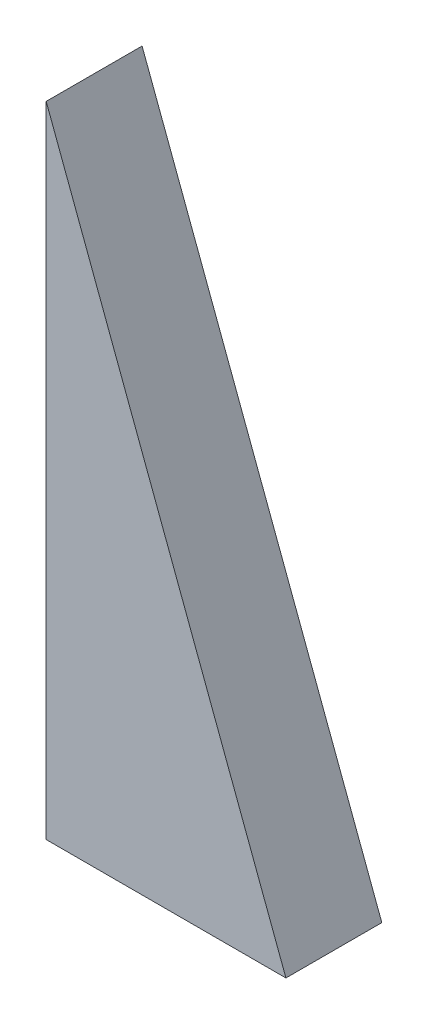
ISO-10303-21;
HEADER;
FILE_DESCRIPTION(('STEP AP214'),'2;1');
FILE_NAME('part.step','',(''),(''),'','','');
FILE_SCHEMA(('AUTOMOTIVE_DESIGN { 1 0 10303 214 1 1 1 1 }'));
ENDSEC;
DATA;
#1=APPLICATION_CONTEXT('core data for automotive mechanical design processes');
#2=APPLICATION_PROTOCOL_DEFINITION('international standard','automotive_design',2000,#1);
#3=PRODUCT_CONTEXT('',#1,'mechanical');
#4=PRODUCT('Part','Part','',(#3));
#5=PRODUCT_RELATED_PRODUCT_CATEGORY('part','',(#4));
#6=PRODUCT_DEFINITION_FORMATION('','',#4);
#7=PRODUCT_DEFINITION_CONTEXT('part definition',#1,'design');
#8=PRODUCT_DEFINITION('design','',#6,#7);
#9=PRODUCT_DEFINITION_SHAPE('','',#8);
#10=(LENGTH_UNIT() NAMED_UNIT(*) SI_UNIT(.MILLI.,.METRE.));
#11=(NAMED_UNIT(*) PLANE_ANGLE_UNIT() SI_UNIT($,.RADIAN.));
#12=(NAMED_UNIT(*) SI_UNIT($,.STERADIAN.) SOLID_ANGLE_UNIT());
#13=UNCERTAINTY_MEASURE_WITH_UNIT(LENGTH_MEASURE(1.E-05),#10,'distance_accuracy_value','');
#14=(GEOMETRIC_REPRESENTATION_CONTEXT(3) GLOBAL_UNCERTAINTY_ASSIGNED_CONTEXT((#13)) GLOBAL_UNIT_ASSIGNED_CONTEXT((#10,
#11,#12)) REPRESENTATION_CONTEXT('',''));
#15=CARTESIAN_POINT('',(0.,0.,0.));
#16=DIRECTION('',(0.,0.,1.));
#17=DIRECTION('',(1.,0.,0.));
#18=AXIS2_PLACEMENT_3D('',#15,#16,#17);
#19=CARTESIAN_POINT('',(8.860009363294,33.860009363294,12.));
#20=DIRECTION('',(0.,0.,1.));
#21=DIRECTION('',(1.,0.,0.));
#22=AXIS2_PLACEMENT_3D('',#19,#20,#21);
#23=PLANE('',#22);
#24=DIRECTION('',(1.,0.,0.));
#25=VECTOR('',#24,1.);
#26=CARTESIAN_POINT('',(0.,0.,12.));
#27=LINE('',#26,#25);
#28=CARTESIAN_POINT('',(0.,0.,12.));
#29=VERTEX_POINT('',#28);
#30=CARTESIAN_POINT('',(30.,0.,12.));
#31=VERTEX_POINT('',#30);
#32=EDGE_CURVE('E78',#29,#31,#27,.T.);
#33=ORIENTED_EDGE('',*,*,#32,.T.);
#34=DIRECTION('',(-0.351123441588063,0.936329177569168,0.));
#35=VECTOR('',#34,1.);
#36=CARTESIAN_POINT('',(30.,0.,12.));
#37=LINE('',#36,#35);
#38=CARTESIAN_POINT('',(0.,80.,12.));
#39=VERTEX_POINT('',#38);
#40=EDGE_CURVE('E54',#31,#39,#37,.T.);
#41=ORIENTED_EDGE('',*,*,#40,.T.);
#42=DIRECTION('',(0.,-1.,0.));
#43=VECTOR('',#42,1.);
#44=CARTESIAN_POINT('',(0.,80.,12.));
#45=LINE('',#44,#43);
#46=EDGE_CURVE('E10',#39,#29,#45,.T.);
#47=ORIENTED_EDGE('',*,*,#46,.T.);
#48=EDGE_LOOP('',(#33,#41,#47));
#49=FACE_BOUND('',#48,.T.);
#50=ADVANCED_FACE('F16',(#49),#23,.T.);
#51=CARTESIAN_POINT('',(8.860009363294,33.860009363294,0.));
#52=DIRECTION('',(0.,0.,1.));
#53=DIRECTION('',(1.,0.,0.));
#54=AXIS2_PLACEMENT_3D('',#51,#52,#53);
#55=PLANE('',#54);
#56=DIRECTION('',(0.,-1.,0.));
#57=VECTOR('',#56,1.);
#58=CARTESIAN_POINT('',(0.,80.,0.));
#59=LINE('',#58,#57);
#60=CARTESIAN_POINT('',(0.,80.,0.));
#61=VERTEX_POINT('',#60);
#62=CARTESIAN_POINT('',(0.,0.,0.));
#63=VERTEX_POINT('',#62);
#64=EDGE_CURVE('E19',#61,#63,#59,.T.);
#65=ORIENTED_EDGE('',*,*,#64,.F.);
#66=DIRECTION('',(-0.351123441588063,0.936329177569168,0.));
#67=VECTOR('',#66,1.);
#68=CARTESIAN_POINT('',(30.,0.,0.));
#69=LINE('',#68,#67);
#70=CARTESIAN_POINT('',(30.,0.,0.));
#71=VERTEX_POINT('',#70);
#72=EDGE_CURVE('E62',#71,#61,#69,.T.);
#73=ORIENTED_EDGE('',*,*,#72,.F.);
#74=DIRECTION('',(1.,0.,0.));
#75=VECTOR('',#74,1.);
#76=CARTESIAN_POINT('',(0.,0.,0.));
#77=LINE('',#76,#75);
#78=EDGE_CURVE('E77',#63,#71,#77,.T.);
#79=ORIENTED_EDGE('',*,*,#78,.F.);
#80=EDGE_LOOP('',(#65,#73,#79));
#81=FACE_BOUND('',#80,.T.);
#82=ADVANCED_FACE('F81',(#81),#55,.F.);
#83=CARTESIAN_POINT('',(0.,80.,0.));
#84=DIRECTION('',(1.,0.,0.));
#85=DIRECTION('',(0.,1.,0.));
#86=AXIS2_PLACEMENT_3D('',#83,#84,#85);
#87=PLANE('',#86);
#88=ORIENTED_EDGE('',*,*,#64,.T.);
#89=DIRECTION('',(0.,0.,1.));
#90=VECTOR('',#89,1.);
#91=CARTESIAN_POINT('',(0.,0.,0.));
#92=LINE('',#91,#90);
#93=EDGE_CURVE('E69',#63,#29,#92,.T.);
#94=ORIENTED_EDGE('',*,*,#93,.T.);
#95=ORIENTED_EDGE('',*,*,#46,.F.);
#96=DIRECTION('',(0.,0.,1.));
#97=VECTOR('',#96,1.);
#98=CARTESIAN_POINT('',(0.,80.,0.));
#99=LINE('',#98,#97);
#100=EDGE_CURVE('E71',#61,#39,#99,.T.);
#101=ORIENTED_EDGE('',*,*,#100,.F.);
#102=EDGE_LOOP('',(#88,#94,#95,#101));
#103=FACE_BOUND('',#102,.T.);
#104=ADVANCED_FACE('F68',(#103),#87,.F.);
#105=CARTESIAN_POINT('',(30.,0.,0.));
#106=DIRECTION('',(-0.936329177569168,-0.351123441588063,0.));
#107=DIRECTION('',(-0.351123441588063,0.936329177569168,0.));
#108=AXIS2_PLACEMENT_3D('',#105,#106,#107);
#109=PLANE('',#108);
#110=ORIENTED_EDGE('',*,*,#72,.T.);
#111=ORIENTED_EDGE('',*,*,#100,.T.);
#112=ORIENTED_EDGE('',*,*,#40,.F.);
#113=DIRECTION('',(0.,0.,1.));
#114=VECTOR('',#113,1.);
#115=CARTESIAN_POINT('',(30.,0.,0.));
#116=LINE('',#115,#114);
#117=EDGE_CURVE('E83',#71,#31,#116,.T.);
#118=ORIENTED_EDGE('',*,*,#117,.F.);
#119=EDGE_LOOP('',(#110,#111,#112,#118));
#120=FACE_BOUND('',#119,.T.);
#121=ADVANCED_FACE('F96',(#120),#109,.F.);
#122=CARTESIAN_POINT('',(0.,0.,0.));
#123=DIRECTION('',(0.,1.,0.));
#124=DIRECTION('',(1.,0.,0.));
#125=AXIS2_PLACEMENT_3D('',#122,#123,#124);
#126=PLANE('',#125);
#127=ORIENTED_EDGE('',*,*,#78,.T.);
#128=ORIENTED_EDGE('',*,*,#117,.T.);
#129=ORIENTED_EDGE('',*,*,#32,.F.);
#130=ORIENTED_EDGE('',*,*,#93,.F.);
#131=EDGE_LOOP('',(#127,#128,#129,#130));
#132=FACE_BOUND('',#131,.T.);
#133=ADVANCED_FACE('F75',(#132),#126,.F.);
#134=CLOSED_SHELL('',(#50,#82,#104,#121,#133));
#135=MANIFOLD_SOLID_BREP('B1',#134);
#136=ADVANCED_BREP_SHAPE_REPRESENTATION('',(#18,#135),#14);
#137=SHAPE_DEFINITION_REPRESENTATION(#9,#136);
ENDSEC;
END-ISO-10303-21;
